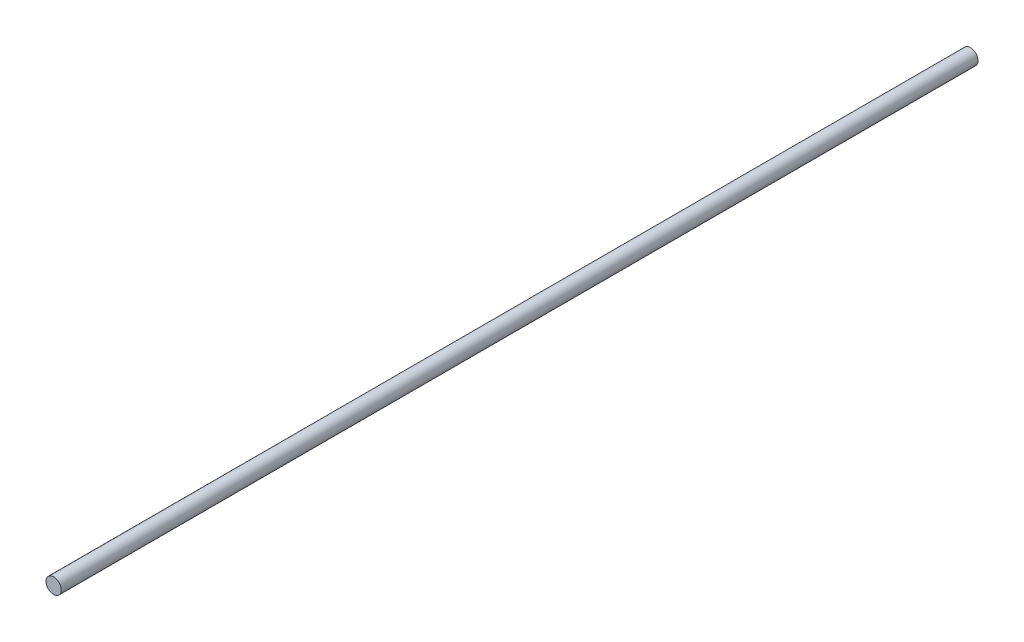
from build123d import *

# Parameters (mm, degrees)
CROQUIS1_R              = 2.5
SALIENTE_EXTRUIR1_DEPTH = 300


with BuildPart() as part:
    # Croquis1 → Saliente-Extruir1 (new body)
    with BuildSketch(Plane.XY):
        Circle(CROQUIS1_R)
    extrude(amount=SALIENTE_EXTRUIR1_DEPTH)


solid = part.part
